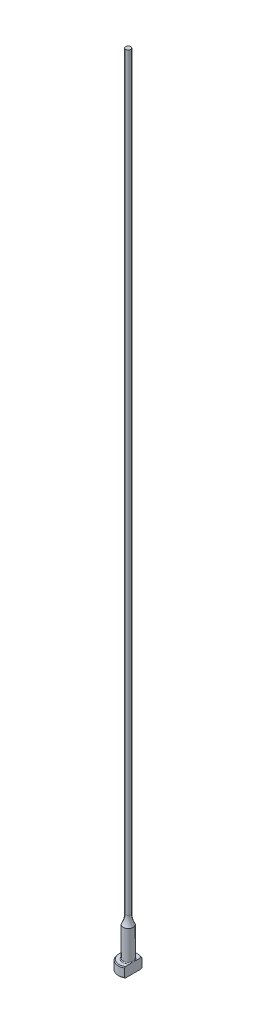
ISO-10303-21;
HEADER;
FILE_DESCRIPTION(('STEP AP214'),'2;1');
FILE_NAME('part.step','',(''),(''),'','','');
FILE_SCHEMA(('AUTOMOTIVE_DESIGN { 1 0 10303 214 1 1 1 1 }'));
ENDSEC;
DATA;
#1=APPLICATION_CONTEXT('core data for automotive mechanical design processes');
#2=APPLICATION_PROTOCOL_DEFINITION('international standard','automotive_design',2000,#1);
#3=PRODUCT_CONTEXT('',#1,'mechanical');
#4=PRODUCT('Part','Part','',(#3));
#5=PRODUCT_RELATED_PRODUCT_CATEGORY('part','',(#4));
#6=PRODUCT_DEFINITION_FORMATION('','',#4);
#7=PRODUCT_DEFINITION_CONTEXT('part definition',#1,'design');
#8=PRODUCT_DEFINITION('design','',#6,#7);
#9=PRODUCT_DEFINITION_SHAPE('','',#8);
#10=(LENGTH_UNIT() NAMED_UNIT(*) SI_UNIT(.MILLI.,.METRE.));
#11=(NAMED_UNIT(*) PLANE_ANGLE_UNIT() SI_UNIT($,.RADIAN.));
#12=(NAMED_UNIT(*) SI_UNIT($,.STERADIAN.) SOLID_ANGLE_UNIT());
#13=UNCERTAINTY_MEASURE_WITH_UNIT(LENGTH_MEASURE(1.E-05),#10,'distance_accuracy_value','');
#14=(GEOMETRIC_REPRESENTATION_CONTEXT(3) GLOBAL_UNCERTAINTY_ASSIGNED_CONTEXT((#13)) GLOBAL_UNIT_ASSIGNED_CONTEXT((#10,
#11,#12)) REPRESENTATION_CONTEXT('',''));
#15=CARTESIAN_POINT('',(0.,0.,0.));
#16=DIRECTION('',(0.,0.,1.));
#17=DIRECTION('',(1.,0.,0.));
#18=AXIS2_PLACEMENT_3D('',#15,#16,#17);
#19=CARTESIAN_POINT('',(-3.17499999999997,3.175,0.));
#20=DIRECTION('',(0.,1.,0.));
#21=DIRECTION('',(0.,0.,1.));
#22=AXIS2_PLACEMENT_3D('',#19,#20,#21);
#23=PLANE('',#22);
#24=CARTESIAN_POINT('',(0.,3.175,0.));
#25=DIRECTION('',(0.,1.,0.));
#26=DIRECTION('',(0.,0.,1.));
#27=AXIS2_PLACEMENT_3D('',#24,#25,#26);
#28=CIRCLE('',#27,2.92099999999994);
#29=CARTESIAN_POINT('',(1.58749999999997,3.175,-2.45195529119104));
#30=VERTEX_POINT('',#29);
#31=CARTESIAN_POINT('',(1.58749999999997,3.175,2.45195529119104));
#32=VERTEX_POINT('',#31);
#33=EDGE_CURVE('E105',#30,#32,#28,.T.);
#34=ORIENTED_EDGE('',*,*,#33,.T.);
#35=DIRECTION('',(0.,0.,1.));
#36=VECTOR('',#35,1.);
#37=CARTESIAN_POINT('',(1.58749999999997,3.17499999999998,2.74963065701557));
#38=LINE('',#37,#36);
#39=CARTESIAN_POINT('',(1.58749999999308,3.175,0.933255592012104));
#40=VERTEX_POINT('',#39);
#41=EDGE_CURVE('E126',#40,#32,#38,.T.);
#42=ORIENTED_EDGE('',*,*,#41,.F.);
#43=CARTESIAN_POINT('',(0.,3.175,0.));
#44=DIRECTION('',(0.,1.,0.));
#45=DIRECTION('',(0.,0.,1.));
#46=AXIS2_PLACEMENT_3D('',#43,#44,#45);
#47=CIRCLE('',#46,1.84149999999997);
#48=CARTESIAN_POINT('',(1.58749999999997,3.17500000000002,-0.933255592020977));
#49=VERTEX_POINT('',#48);
#50=EDGE_CURVE('E11',#40,#49,#47,.F.);
#51=ORIENTED_EDGE('',*,*,#50,.T.);
#52=EDGE_CURVE('E52',#30,#49,#38,.T.);
#53=ORIENTED_EDGE('',*,*,#52,.F.);
#54=EDGE_LOOP('',(#34,#42,#51,#53));
#55=FACE_BOUND('',#54,.T.);
#56=ADVANCED_FACE('F32',(#55),#23,.T.);
#57=CARTESIAN_POINT('',(0.,259.958771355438,0.));
#58=DIRECTION('',(0.,1.,0.));
#59=DIRECTION('',(0.,0.,1.));
#60=AXIS2_PLACEMENT_3D('',#57,#58,#59);
#61=CYLINDRICAL_SURFACE('',#60,3.17499999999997);
#62=CARTESIAN_POINT('',(0.,2.92100000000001,0.));
#63=DIRECTION('',(0.,1.,0.));
#64=DIRECTION('',(0.,0.,1.));
#65=AXIS2_PLACEMENT_3D('',#62,#63,#64);
#66=CIRCLE('',#65,3.17499999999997);
#67=CARTESIAN_POINT('',(1.58749999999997,2.92100000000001,2.74963065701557));
#68=VERTEX_POINT('',#67);
#69=CARTESIAN_POINT('',(1.58749999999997,2.92100000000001,-2.74963065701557));
#70=VERTEX_POINT('',#69);
#71=EDGE_CURVE('E98',#68,#70,#66,.F.);
#72=ORIENTED_EDGE('',*,*,#71,.T.);
#73=DIRECTION('',(0.,-1.,0.));
#74=VECTOR('',#73,1.);
#75=CARTESIAN_POINT('',(1.58749999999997,254.001,-2.74963065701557));
#76=LINE('',#75,#74);
#77=CARTESIAN_POINT('',(1.58749999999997,0.253999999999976,-2.74963065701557));
#78=VERTEX_POINT('',#77);
#79=EDGE_CURVE('E141',#70,#78,#76,.T.);
#80=ORIENTED_EDGE('',*,*,#79,.T.);
#81=CARTESIAN_POINT('',(0.,0.253999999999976,0.));
#82=DIRECTION('',(0.,-1.,0.));
#83=DIRECTION('',(0.,0.,-1.));
#84=AXIS2_PLACEMENT_3D('',#81,#82,#83);
#85=CIRCLE('',#84,3.17499999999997);
#86=CARTESIAN_POINT('',(1.58749999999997,0.253999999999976,2.74963065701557));
#87=VERTEX_POINT('',#86);
#88=EDGE_CURVE('E95',#78,#87,#85,.F.);
#89=ORIENTED_EDGE('',*,*,#88,.T.);
#90=DIRECTION('',(0.,-1.,0.));
#91=VECTOR('',#90,1.);
#92=CARTESIAN_POINT('',(1.58749999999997,254.001,2.74963065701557));
#93=LINE('',#92,#91);
#94=EDGE_CURVE('E88',#68,#87,#93,.T.);
#95=ORIENTED_EDGE('',*,*,#94,.F.);
#96=EDGE_LOOP('',(#72,#80,#89,#95));
#97=FACE_BOUND('',#96,.T.);
#98=ADVANCED_FACE('F191',(#97),#61,.T.);
#99=CARTESIAN_POINT('',(0.,0.,0.));
#100=DIRECTION('',(0.,-1.,0.));
#101=DIRECTION('',(0.,0.,-1.));
#102=AXIS2_PLACEMENT_3D('',#99,#100,#101);
#103=PLANE('',#102);
#104=CARTESIAN_POINT('',(0.,0.,0.));
#105=DIRECTION('',(0.,-1.,0.));
#106=DIRECTION('',(0.,0.,-1.));
#107=AXIS2_PLACEMENT_3D('',#104,#105,#106);
#108=CIRCLE('',#107,2.92100000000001);
#109=CARTESIAN_POINT('',(1.58749999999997,0.,2.45195529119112));
#110=VERTEX_POINT('',#109);
#111=CARTESIAN_POINT('',(1.58749999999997,0.,-2.45195529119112));
#112=VERTEX_POINT('',#111);
#113=EDGE_CURVE('E93',#110,#112,#108,.T.);
#114=ORIENTED_EDGE('',*,*,#113,.T.);
#115=DIRECTION('',(0.,0.,1.));
#116=VECTOR('',#115,1.);
#117=CARTESIAN_POINT('',(1.58749999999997,0.,2.74963065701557));
#118=LINE('',#117,#116);
#119=EDGE_CURVE('E78',#112,#110,#118,.T.);
#120=ORIENTED_EDGE('',*,*,#119,.T.);
#121=EDGE_LOOP('',(#114,#120));
#122=FACE_BOUND('',#121,.T.);
#123=ADVANCED_FACE('F97',(#122),#103,.T.);
#124=CARTESIAN_POINT('',(0.,3.17499999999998,0.));
#125=DIRECTION('',(0.,-1.,0.));
#126=DIRECTION('',(0.,0.,-1.));
#127=AXIS2_PLACEMENT_3D('',#124,#125,#126);
#128=CONICAL_SURFACE('',#127,2.92099999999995,0.785398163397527);
#129=ORIENTED_EDGE('',*,*,#71,.F.);
#130=CARTESIAN_POINT('',(1.58749999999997,-0.16162066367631,-6.0529050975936));
#131=CARTESIAN_POINT('',(1.58749999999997,-0.0288893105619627,-5.91567682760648));
#132=CARTESIAN_POINT('',(1.58749999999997,0.103699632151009,-5.7783103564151));
#133=CARTESIAN_POINT('',(1.58749999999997,0.368508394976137,-5.50321874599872));
#134=CARTESIAN_POINT('',(1.58749999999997,0.500728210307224,-5.36549360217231));
#135=CARTESIAN_POINT('',(1.58749999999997,0.764778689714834,-5.08953516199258));
#136=CARTESIAN_POINT('',(1.58749999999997,0.896609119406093,-4.9513016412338));
#137=CARTESIAN_POINT('',(1.58749999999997,1.15968706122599,-4.67428233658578));
#138=CARTESIAN_POINT('',(1.58749999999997,1.29093457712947,-4.53549655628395));
#139=CARTESIAN_POINT('',(1.58749999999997,1.55007705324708,-4.25997724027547));
#140=CARTESIAN_POINT('',(1.58749999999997,1.67798684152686,-4.12325766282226));
#141=CARTESIAN_POINT('',(1.58749999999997,1.9328486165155,-3.84892898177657));
#142=CARTESIAN_POINT('',(1.58749999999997,2.05980060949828,-3.71131988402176));
#143=CARTESIAN_POINT('',(1.58749999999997,2.31237508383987,-3.43493978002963));
#144=CARTESIAN_POINT('',(1.58749999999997,2.43799784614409,-3.29616903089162));
#145=CARTESIAN_POINT('',(1.58749999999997,2.68741369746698,-3.01699558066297));
#146=CARTESIAN_POINT('',(1.58749999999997,2.81120686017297,-2.8765929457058));
#147=CARTESIAN_POINT('',(1.58749999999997,3.00875865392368,-2.64816703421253));
#148=CARTESIAN_POINT('',(1.58749999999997,3.08336151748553,-2.56087478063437));
#149=CARTESIAN_POINT('',(1.58749999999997,3.2312387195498,-2.38515423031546));
#150=CARTESIAN_POINT('',(1.58749999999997,3.30451292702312,-2.29672582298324));
#151=CARTESIAN_POINT('',(1.58749999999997,3.45004422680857,-2.1174740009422));
#152=CARTESIAN_POINT('',(1.58749999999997,3.5222823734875,-2.02663514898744));
#153=CARTESIAN_POINT('',(1.58749999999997,3.66423097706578,-1.8430252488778));
#154=CARTESIAN_POINT('',(1.58749999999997,3.73394203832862,-1.75025467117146));
#155=CARTESIAN_POINT('',(1.58749999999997,3.87080633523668,-1.5606747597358));
#156=CARTESIAN_POINT('',(1.58749999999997,3.93790459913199,-1.46382547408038));
#157=CARTESIAN_POINT('',(1.58749999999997,4.06669147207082,-1.26632594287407));
#158=CARTESIAN_POINT('',(1.58749999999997,4.1283726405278,-1.16567073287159));
#159=CARTESIAN_POINT('',(1.58749999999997,4.21402252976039,-1.01165766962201));
#160=CARTESIAN_POINT('',(1.58749999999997,4.24127929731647,-0.960142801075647));
#161=CARTESIAN_POINT('',(1.58749999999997,4.2930979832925,-0.855780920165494));
#162=CARTESIAN_POINT('',(1.58749999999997,4.31765941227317,-0.802933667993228));
#163=CARTESIAN_POINT('',(1.58749999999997,4.38614656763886,-0.642461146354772));
#164=CARTESIAN_POINT('',(1.58749999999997,4.42510149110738,-0.532518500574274));
#165=CARTESIAN_POINT('',(1.58749999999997,4.46726244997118,-0.367680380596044));
#166=CARTESIAN_POINT('',(1.58749999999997,4.47844427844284,-0.314802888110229));
#167=CARTESIAN_POINT('',(1.58749999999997,4.49576654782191,-0.208209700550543));
#168=CARTESIAN_POINT('',(1.58749999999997,4.50190743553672,-0.154494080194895));
#169=CARTESIAN_POINT('',(1.58749999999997,4.50871296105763,-0.0468792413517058));
#170=CARTESIAN_POINT('',(1.58749999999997,4.5093945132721,0.00701889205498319));
#171=CARTESIAN_POINT('',(1.58749999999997,4.50527679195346,0.114606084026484));
#172=CARTESIAN_POINT('',(1.58749999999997,4.50047706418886,0.168295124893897));
#173=CARTESIAN_POINT('',(1.58749999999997,4.48579689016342,0.27448544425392));
#174=CARTESIAN_POINT('',(1.58749999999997,4.47596081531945,0.32699298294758));
#175=CARTESIAN_POINT('',(1.58749999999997,4.45181809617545,0.430974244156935));
#176=CARTESIAN_POINT('',(1.58749999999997,4.4375096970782,0.482447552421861));
#177=CARTESIAN_POINT('',(1.58749999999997,4.40502489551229,0.584460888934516));
#178=CARTESIAN_POINT('',(1.58749999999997,4.386827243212,0.634994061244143));
#179=CARTESIAN_POINT('',(1.58749999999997,4.34729308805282,0.734789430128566));
#180=CARTESIAN_POINT('',(1.58749999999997,4.3259572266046,0.784051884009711));
#181=CARTESIAN_POINT('',(1.58749999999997,4.25791922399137,0.930549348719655));
#182=CARTESIAN_POINT('',(1.58749999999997,4.20736047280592,1.0259880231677));
#183=CARTESIAN_POINT('',(1.58749999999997,4.0995545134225,1.21304313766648));
#184=CARTESIAN_POINT('',(1.58749999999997,4.04229912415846,1.30465471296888));
#185=CARTESIAN_POINT('',(1.58749999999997,3.92308746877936,1.48526211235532));
#186=CARTESIAN_POINT('',(1.58749999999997,3.86111349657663,1.57424615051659));
#187=CARTESIAN_POINT('',(1.58749999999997,3.73408621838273,1.74990003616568));
#188=CARTESIAN_POINT('',(1.58749999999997,3.66903444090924,1.83657099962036));
#189=CARTESIAN_POINT('',(1.58749999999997,3.53583371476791,2.00931764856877));
#190=CARTESIAN_POINT('',(1.58749999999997,3.46765527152,2.09537048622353));
#191=CARTESIAN_POINT('',(1.58749999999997,3.32960643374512,2.26611736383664));
#192=CARTESIAN_POINT('',(1.58749999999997,3.25973586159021,2.35081125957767));
#193=CARTESIAN_POINT('',(1.58749999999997,3.04858139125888,2.60290121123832));
#194=CARTESIAN_POINT('',(1.58749999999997,2.90542388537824,2.76872537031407));
#195=CARTESIAN_POINT('',(1.58749999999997,2.64069522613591,3.06970913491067));
#196=CARTESIAN_POINT('',(1.58749999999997,2.51959458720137,3.20528660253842));
#197=CARTESIAN_POINT('',(1.58749999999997,2.27590400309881,3.47510321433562));
#198=CARTESIAN_POINT('',(1.58749999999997,2.15331401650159,3.60934232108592));
#199=CARTESIAN_POINT('',(1.58749999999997,1.90694239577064,3.87695374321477));
#200=CARTESIAN_POINT('',(1.58749999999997,1.78315974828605,4.0103251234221));
#201=CARTESIAN_POINT('',(1.58749999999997,1.53478104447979,4.27630880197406));
#202=CARTESIAN_POINT('',(1.58749999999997,1.41018498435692,4.40892109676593));
#203=CARTESIAN_POINT('',(1.58749999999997,1.0457468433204,4.79499418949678));
#204=CARTESIAN_POINT('',(1.58749999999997,0.80507680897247,5.04767313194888));
#205=CARTESIAN_POINT('',(1.58749999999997,0.443121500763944,5.42550911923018));
#206=CARTESIAN_POINT('',(1.58749999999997,0.322378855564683,5.55118772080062));
#207=CARTESIAN_POINT('',(1.58749999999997,0.0805914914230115,5.80225207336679));
#208=CARTESIAN_POINT('',(1.58749999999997,-0.040453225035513,5.92763782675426));
#209=CARTESIAN_POINT('',(1.58749999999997,-0.161620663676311,6.0529050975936));
#210=B_SPLINE_CURVE_WITH_KNOTS('',3,(#130,#131,#132,#133,#134,#135,#136,#137,#138,#139,#140,
#141,#142,#143,#144,#145,#146,#147,#148,#149,#150,#151,#152,#153,#154,#155,#156,#157,#158,#159,
#160,#161,#162,#163,#164,#165,#166,#167,#168,#169,#170,#171,#172,#173,#174,#175,#176,#177,#178,
#179,#180,#181,#182,#183,#184,#185,#186,#187,#188,#189,#190,#191,#192,#193,#194,#195,#196,#197,
#198,#199,#200,#201,#202,#203,#204,#205,#206,#207,#208,#209),.UNSPECIFIED.,.F.,.F.,(4,2,2,2,2,2,
2,2,2,2,2,2,2,2,2,2,2,2,2,2,2,2,2,2,2,2,2,2,2,2,2,2,2,2,2,2,2,2,2,4),(0.,0.572750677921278,
1.14550874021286,1.71856057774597,2.29160869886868,2.85328006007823,3.4149477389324,
3.97649423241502,4.53801804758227,4.88249307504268,5.22700189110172,5.5751532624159,
5.92322081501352,6.27657800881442,6.63041319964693,6.80518126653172,6.9799810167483,
7.3282426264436,7.49018491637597,7.65211285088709,7.81353889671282,7.97497832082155,
8.13501929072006,8.29512313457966,8.45612518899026,8.61709438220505,8.94062993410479,
9.2645649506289,9.58978187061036,9.91483894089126,10.2441741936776,10.5735441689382,
11.2306812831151,11.7760337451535,12.3214014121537,12.8672825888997,13.4131663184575,
14.4600164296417,14.9828595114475,15.5056983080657),.UNSPECIFIED.);
#211=EDGE_CURVE('E118',#32,#68,#210,.T.);
#212=ORIENTED_EDGE('',*,*,#211,.F.);
#213=ORIENTED_EDGE('',*,*,#33,.F.);
#214=EDGE_CURVE('E117',#70,#30,#210,.T.);
#215=ORIENTED_EDGE('',*,*,#214,.F.);
#216=EDGE_LOOP('',(#129,#212,#213,#215));
#217=FACE_BOUND('',#216,.T.);
#218=ADVANCED_FACE('F162',(#217),#128,.T.);
#219=CARTESIAN_POINT('',(0.,0.253999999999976,0.));
#220=DIRECTION('',(0.,1.,0.));
#221=DIRECTION('',(0.,0.,1.));
#222=AXIS2_PLACEMENT_3D('',#219,#220,#221);
#223=CONICAL_SURFACE('',#222,3.17499999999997,0.785398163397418);
#224=ORIENTED_EDGE('',*,*,#88,.F.);
#225=CARTESIAN_POINT('',(1.58749999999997,3.33662066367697,6.0529050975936));
#226=CARTESIAN_POINT('',(1.58749999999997,3.20388931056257,5.91567682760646));
#227=CARTESIAN_POINT('',(1.58749999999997,3.07130036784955,5.77831035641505));
#228=CARTESIAN_POINT('',(1.58749999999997,2.80649160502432,5.50321874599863));
#229=CARTESIAN_POINT('',(1.58749999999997,2.67427178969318,5.3654936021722));
#230=CARTESIAN_POINT('',(1.58749999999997,2.41022131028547,5.08953516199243));
#231=CARTESIAN_POINT('',(1.58749999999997,2.27839088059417,4.95130164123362));
#232=CARTESIAN_POINT('',(1.58749999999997,2.01531293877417,4.67428233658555));
#233=CARTESIAN_POINT('',(1.58749999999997,1.88406542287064,4.5354965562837));
#234=CARTESIAN_POINT('',(1.58749999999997,1.62492294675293,4.25997724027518));
#235=CARTESIAN_POINT('',(1.58749999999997,1.49701315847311,4.12325766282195));
#236=CARTESIAN_POINT('',(1.58749999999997,1.24215138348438,3.84892898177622));
#237=CARTESIAN_POINT('',(1.58749999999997,1.11519939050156,3.71131988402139));
#238=CARTESIAN_POINT('',(1.58749999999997,0.862624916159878,3.43493978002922));
#239=CARTESIAN_POINT('',(1.58749999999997,0.737002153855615,3.29616903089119));
#240=CARTESIAN_POINT('',(1.58749999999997,0.487586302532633,3.01699558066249));
#241=CARTESIAN_POINT('',(1.58749999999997,0.363793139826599,2.8765929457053));
#242=CARTESIAN_POINT('',(1.58749999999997,0.166241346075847,2.64816703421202));
#243=CARTESIAN_POINT('',(1.58749999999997,0.0916384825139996,2.56087478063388));
#244=CARTESIAN_POINT('',(1.58749999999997,-0.0562387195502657,2.385154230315));
#245=CARTESIAN_POINT('',(1.58749999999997,-0.129512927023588,2.29672582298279));
#246=CARTESIAN_POINT('',(1.58749999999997,-0.27504422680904,2.11747400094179));
#247=CARTESIAN_POINT('',(1.58749999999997,-0.347282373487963,2.02663514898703));
#248=CARTESIAN_POINT('',(1.58749999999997,-0.489230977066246,1.84302524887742));
#249=CARTESIAN_POINT('',(1.58749999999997,-0.558942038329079,1.7502546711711));
#250=CARTESIAN_POINT('',(1.58749999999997,-0.695806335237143,1.56067475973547));
#251=CARTESIAN_POINT('',(1.58749999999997,-0.762904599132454,1.46382547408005));
#252=CARTESIAN_POINT('',(1.58749999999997,-0.891691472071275,1.26632594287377));
#253=CARTESIAN_POINT('',(1.58749999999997,-0.953372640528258,1.16567073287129));
#254=CARTESIAN_POINT('',(1.58749999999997,-1.03902252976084,1.01165766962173));
#255=CARTESIAN_POINT('',(1.58749999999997,-1.06627929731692,0.960142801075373));
#256=CARTESIAN_POINT('',(1.58749999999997,-1.11809798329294,0.85578092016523));
#257=CARTESIAN_POINT('',(1.58749999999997,-1.14265941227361,0.802933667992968));
#258=CARTESIAN_POINT('',(1.58749999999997,-1.21114656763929,0.642461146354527));
#259=CARTESIAN_POINT('',(1.58749999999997,-1.2501014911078,0.532518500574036));
#260=CARTESIAN_POINT('',(1.58749999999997,-1.29226244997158,0.367680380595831));
#261=CARTESIAN_POINT('',(1.58749999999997,-1.30344427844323,0.314802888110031));
#262=CARTESIAN_POINT('',(1.58749999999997,-1.32076654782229,0.208209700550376));
#263=CARTESIAN_POINT('',(1.58749999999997,-1.3269074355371,0.154494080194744));
#264=CARTESIAN_POINT('',(1.58749999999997,-1.333712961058,0.0468792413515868));
#265=CARTESIAN_POINT('',(1.58749999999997,-1.33439451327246,-0.00701889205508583));
#266=CARTESIAN_POINT('',(1.58749999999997,-1.33027679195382,-0.114606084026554));
#267=CARTESIAN_POINT('',(1.58749999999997,-1.32547706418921,-0.168295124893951));
#268=CARTESIAN_POINT('',(1.58749999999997,-1.31079689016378,-0.274485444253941));
#269=CARTESIAN_POINT('',(1.58749999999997,-1.3009608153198,-0.326992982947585));
#270=CARTESIAN_POINT('',(1.58749999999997,-1.27681809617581,-0.430974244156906));
#271=CARTESIAN_POINT('',(1.58749999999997,-1.26250969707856,-0.482447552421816));
#272=CARTESIAN_POINT('',(1.58749999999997,-1.23002489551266,-0.584460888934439));
#273=CARTESIAN_POINT('',(1.58749999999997,-1.21182724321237,-0.634994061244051));
#274=CARTESIAN_POINT('',(1.58749999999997,-1.1722930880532,-0.734789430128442));
#275=CARTESIAN_POINT('',(1.58749999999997,-1.15095722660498,-0.784051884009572));
#276=CARTESIAN_POINT('',(1.58749999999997,-1.08291922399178,-0.93054934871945));
#277=CARTESIAN_POINT('',(1.58749999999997,-1.03236047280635,-1.02598802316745));
#278=CARTESIAN_POINT('',(1.58749999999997,-0.924554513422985,-1.21304313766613));
#279=CARTESIAN_POINT('',(1.58749999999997,-0.86729912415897,-1.30465471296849));
#280=CARTESIAN_POINT('',(1.58749999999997,-0.748087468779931,-1.48526211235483));
#281=CARTESIAN_POINT('',(1.58749999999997,-0.686113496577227,-1.57424615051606));
#282=CARTESIAN_POINT('',(1.58749999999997,-0.55908621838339,-1.74990003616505));
#283=CARTESIAN_POINT('',(1.58749999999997,-0.494034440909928,-1.83657099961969));
#284=CARTESIAN_POINT('',(1.58749999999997,-0.360833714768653,-2.00931764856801));
#285=CARTESIAN_POINT('',(1.58749999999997,-0.292655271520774,-2.09537048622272));
#286=CARTESIAN_POINT('',(1.58749999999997,-0.154606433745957,-2.26611736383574));
#287=CARTESIAN_POINT('',(1.58749999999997,-0.0847358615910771,-2.35081125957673));
#288=CARTESIAN_POINT('',(1.58749999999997,0.126418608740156,-2.60290121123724));
#289=CARTESIAN_POINT('',(1.58749999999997,0.269576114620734,-2.76872537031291));
#290=CARTESIAN_POINT('',(1.58749999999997,0.534304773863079,-3.06970913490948));
#291=CARTESIAN_POINT('',(1.58749999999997,0.655405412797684,-3.20528660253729));
#292=CARTESIAN_POINT('',(1.58749999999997,0.899095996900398,-3.47510321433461));
#293=CARTESIAN_POINT('',(1.58749999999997,1.02168598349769,-3.60934232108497));
#294=CARTESIAN_POINT('',(1.58749999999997,1.26805760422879,-3.87695374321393));
#295=CARTESIAN_POINT('',(1.58749999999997,1.39184025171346,-4.01032512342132));
#296=CARTESIAN_POINT('',(1.58749999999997,1.64021895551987,-4.2763088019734));
#297=CARTESIAN_POINT('',(1.58749999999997,1.76481501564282,-4.40892109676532));
#298=CARTESIAN_POINT('',(1.58749999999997,2.12925315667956,-4.79499418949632));
#299=CARTESIAN_POINT('',(1.58749999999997,2.36992319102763,-5.04767313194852));
#300=CARTESIAN_POINT('',(1.58749999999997,2.73187849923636,-5.42550911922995));
#301=CARTESIAN_POINT('',(1.58749999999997,2.85262114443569,-5.55118772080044));
#302=CARTESIAN_POINT('',(1.58749999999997,3.09440850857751,-5.8022520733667));
#303=CARTESIAN_POINT('',(1.58749999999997,3.2154532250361,-5.92763782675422));
#304=CARTESIAN_POINT('',(1.58749999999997,3.33662066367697,-6.0529050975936));
#305=B_SPLINE_CURVE_WITH_KNOTS('',3,(#225,#226,#227,#228,#229,#230,#231,#232,#233,#234,#235,
#236,#237,#238,#239,#240,#241,#242,#243,#244,#245,#246,#247,#248,#249,#250,#251,#252,#253,#254,
#255,#256,#257,#258,#259,#260,#261,#262,#263,#264,#265,#266,#267,#268,#269,#270,#271,#272,#273,
#274,#275,#276,#277,#278,#279,#280,#281,#282,#283,#284,#285,#286,#287,#288,#289,#290,#291,#292,
#293,#294,#295,#296,#297,#298,#299,#300,#301,#302,#303,#304),.UNSPECIFIED.,.F.,.F.,(4,2,2,2,2,2,
2,2,2,2,2,2,2,2,2,2,2,2,2,2,2,2,2,2,2,2,2,2,2,2,2,2,2,2,2,2,2,2,2,4),(0.,0.57275067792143,
1.14550874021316,1.71856057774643,2.29160869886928,2.85328006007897,3.41494773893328,
3.97649423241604,4.53801804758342,4.88249307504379,5.2270018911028,5.57515326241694,
5.92322081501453,6.27657800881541,6.63041319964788,6.80518126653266,6.97998101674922,
7.32824262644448,7.49018491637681,7.65211285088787,7.81353889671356,7.97497832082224,
8.1350192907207,8.29512313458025,8.45612518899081,8.61709438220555,8.94062993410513,
9.26456495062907,9.58978187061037,9.91483894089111,10.2441741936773,10.5735441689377,
11.2306812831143,11.776033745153,12.3214014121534,12.8672825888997,13.4131663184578,
14.4600164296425,14.9828595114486,15.505698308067),.UNSPECIFIED.);
#306=EDGE_CURVE('E81',#112,#78,#305,.T.);
#307=ORIENTED_EDGE('',*,*,#306,.F.);
#308=ORIENTED_EDGE('',*,*,#113,.F.);
#309=EDGE_CURVE('E84',#87,#110,#305,.T.);
#310=ORIENTED_EDGE('',*,*,#309,.F.);
#311=EDGE_LOOP('',(#224,#307,#308,#310));
#312=FACE_BOUND('',#311,.T.);
#313=ADVANCED_FACE('F92',(#312),#223,.T.);
#314=CARTESIAN_POINT('',(0.,3.42900000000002,0.));
#315=DIRECTION('',(0.,1.,0.));
#316=DIRECTION('',(0.,0.,1.));
#317=AXIS2_PLACEMENT_3D('',#314,#315,#316);
#318=TOROIDAL_SURFACE('',#317,1.84149999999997,0.254);
#319=CARTESIAN_POINT('',(1.58749999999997,3.42900000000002,0.));
#320=CARTESIAN_POINT('',(1.58749999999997,3.42899942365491,-1.9220514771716E-10));
#321=CARTESIAN_POINT('',(1.58749999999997,3.42899884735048,-1.2261161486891E-07));
#322=CARTESIAN_POINT('',(1.58749999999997,3.42899773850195,-5.09676365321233E-07));
#323=CARTESIAN_POINT('',(1.58749999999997,3.42899720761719,-7.78176328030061E-07));
#324=CARTESIAN_POINT('',(1.58749999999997,3.42899614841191,-1.42307272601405E-06));
#325=CARTESIAN_POINT('',(1.58749999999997,3.42899562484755,-1.80713867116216E-06));
#326=CARTESIAN_POINT('',(1.58749999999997,3.42899463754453,-2.63494846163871E-06));
#327=CARTESIAN_POINT('',(1.58749999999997,3.42899417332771,-3.07814756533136E-06));
#328=CARTESIAN_POINT('',(1.58749999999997,3.42899261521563,-4.66897357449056E-06));
#329=CARTESIAN_POINT('',(1.58749999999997,3.42899159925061,-5.89404908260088E-06));
#330=CARTESIAN_POINT('',(1.58749999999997,3.42898979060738,-8.42427511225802E-06));
#331=CARTESIAN_POINT('',(1.58749999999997,3.42898899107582,-9.7248057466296E-06));
#332=CARTESIAN_POINT('',(1.58749999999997,3.42898598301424,-1.48060601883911E-05));
#333=CARTESIAN_POINT('',(1.58749999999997,3.42898393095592,-1.86838281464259E-05));
#334=CARTESIAN_POINT('',(1.58749999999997,3.42898057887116,-2.63261117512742E-05));
#335=CARTESIAN_POINT('',(1.58749999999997,3.42897922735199,-3.00687417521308E-05));
#336=CARTESIAN_POINT('',(1.58749999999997,3.42897347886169,-4.60276298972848E-05));
#337=CARTESIAN_POINT('',(1.58749999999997,3.42896911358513,-5.8247019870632E-05));
#338=CARTESIAN_POINT('',(1.58749999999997,3.42896211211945,-8.11070097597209E-05));
#339=CARTESIAN_POINT('',(1.58749999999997,3.42895931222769,-9.16953114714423E-05));
#340=CARTESIAN_POINT('',(1.58749999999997,3.42893712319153,-0.000168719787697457));
#341=CARTESIAN_POINT('',(1.58749999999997,3.42890881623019,-0.000232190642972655));
#342=CARTESIAN_POINT('',(1.58749999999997,3.42880276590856,-0.000479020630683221));
#343=CARTESIAN_POINT('',(1.58749999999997,3.42873165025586,-0.00066443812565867));
#344=CARTESIAN_POINT('',(1.58749999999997,3.42845137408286,-0.0013844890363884));
#345=CARTESIAN_POINT('',(1.58749999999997,3.42823526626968,-0.00191701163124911));
#346=CARTESIAN_POINT('',(1.58749999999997,3.42735449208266,-0.00409774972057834));
#347=CARTESIAN_POINT('',(1.58749999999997,3.42669768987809,-0.00574830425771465));
#348=CARTESIAN_POINT('',(1.58749999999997,3.4174405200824,-0.0289985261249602));
#349=CARTESIAN_POINT('',(1.58749999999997,3.40878325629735,-0.0505816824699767));
#350=CARTESIAN_POINT('',(1.58749999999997,3.39189297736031,-0.0929947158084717));
#351=CARTESIAN_POINT('',(1.58749999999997,3.38365605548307,-0.11382315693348));
#352=CARTESIAN_POINT('',(1.58749999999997,3.36635393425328,-0.157956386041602));
#353=CARTESIAN_POINT('',(1.58749999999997,3.35730391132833,-0.181267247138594));
#354=CARTESIAN_POINT('',(1.58749999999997,3.33936775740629,-0.228222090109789));
#355=CARTESIAN_POINT('',(1.58749999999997,3.33048420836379,-0.25186705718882));
#356=CARTESIAN_POINT('',(1.58749999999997,3.30894496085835,-0.310512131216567));
#357=CARTESIAN_POINT('',(1.58749999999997,3.29649449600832,-0.345588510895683));
#358=CARTESIAN_POINT('',(1.58749999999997,3.27296975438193,-0.415278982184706));
#359=CARTESIAN_POINT('',(1.58749999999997,3.26186987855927,-0.449884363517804));
#360=CARTESIAN_POINT('',(1.58749999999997,3.2395832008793,-0.524471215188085));
#361=CARTESIAN_POINT('',(1.58749999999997,3.22860862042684,-0.564517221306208));
#362=CARTESIAN_POINT('',(1.58749999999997,3.20902534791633,-0.645529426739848));
#363=CARTESIAN_POINT('',(1.58749999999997,3.20043582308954,-0.686500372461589));
#364=CARTESIAN_POINT('',(1.58749999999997,3.18611712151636,-0.771546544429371));
#365=CARTESIAN_POINT('',(1.58749999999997,3.18059550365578,-0.815658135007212));
#366=CARTESIAN_POINT('',(1.58749999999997,3.17455396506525,-0.904117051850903));
#367=CARTESIAN_POINT('',(1.58749999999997,3.17401361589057,-0.948462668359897));
#368=CARTESIAN_POINT('',(1.58749999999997,3.17898948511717,-1.02531896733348));
#369=CARTESIAN_POINT('',(1.58749999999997,3.1829739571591,-1.05792141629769));
#370=CARTESIAN_POINT('',(1.58749999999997,3.19569167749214,-1.12184393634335));
#371=CARTESIAN_POINT('',(1.58749999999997,3.20436049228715,-1.1531753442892));
#372=CARTESIAN_POINT('',(1.58749999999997,3.22236152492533,-1.19946468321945));
#373=CARTESIAN_POINT('',(1.58749999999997,3.2295150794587,-1.21526783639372));
#374=CARTESIAN_POINT('',(1.58749999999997,3.24587062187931,-1.24583726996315));
#375=CARTESIAN_POINT('',(1.58749999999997,3.25507530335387,-1.26060215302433));
#376=CARTESIAN_POINT('',(1.58749999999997,3.27378481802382,-1.28575815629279));
#377=CARTESIAN_POINT('',(1.58749999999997,3.28289001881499,-1.29644383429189));
#378=CARTESIAN_POINT('',(1.58749999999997,3.30268460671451,-1.31623154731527));
#379=CARTESIAN_POINT('',(1.58749999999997,3.31337067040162,-1.32533681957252));
#380=CARTESIAN_POINT('',(1.58749999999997,3.33349977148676,-1.33941140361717));
#381=CARTESIAN_POINT('',(1.58749999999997,3.34261446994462,-1.34484814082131));
#382=CARTESIAN_POINT('',(1.58749999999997,3.36161455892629,-1.35416329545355));
#383=CARTESIAN_POINT('',(1.58749999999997,3.37149946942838,-1.35804267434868));
#384=CARTESIAN_POINT('',(1.58749999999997,3.39188678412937,-1.36398436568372));
#385=CARTESIAN_POINT('',(1.58749999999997,3.40239309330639,-1.36603350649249));
#386=CARTESIAN_POINT('',(1.58749999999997,3.42360372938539,-1.3680840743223));
#387=CARTESIAN_POINT('',(1.58749999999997,3.43430795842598,-1.36808648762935));
#388=CARTESIAN_POINT('',(1.58749999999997,3.45433283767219,-1.36616208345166));
#389=CARTESIAN_POINT('',(1.58749999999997,3.46367506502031,-1.36444960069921));
#390=CARTESIAN_POINT('',(1.58749999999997,3.48195519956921,-1.35953338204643));
#391=CARTESIAN_POINT('',(1.58749999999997,3.49089304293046,-1.3563294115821));
#392=CARTESIAN_POINT('',(1.58749999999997,3.50850302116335,-1.34848006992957));
#393=CARTESIAN_POINT('',(1.58749999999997,3.5171531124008,-1.34378578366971));
#394=CARTESIAN_POINT('',(1.58749999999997,3.53371257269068,-1.33324445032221));
#395=CARTESIAN_POINT('',(1.58749999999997,3.54162163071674,-1.32739692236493));
#396=CARTESIAN_POINT('',(1.58749999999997,3.56107121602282,-1.31107304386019));
#397=CARTESIAN_POINT('',(1.58749999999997,3.57202221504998,-1.29989286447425));
#398=CARTESIAN_POINT('',(1.58749999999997,3.59202509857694,-1.27593566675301));
#399=CARTESIAN_POINT('',(1.58749999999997,3.60107086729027,-1.26315370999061));
#400=CARTESIAN_POINT('',(1.58749999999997,3.62186023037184,-1.22930733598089));
#401=CARTESIAN_POINT('',(1.58749999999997,3.63240584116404,-1.20751096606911));
#402=CARTESIAN_POINT('',(1.58749999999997,3.65004643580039,-1.16266144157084));
#403=CARTESIAN_POINT('',(1.58749999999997,3.65714435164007,-1.13960937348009));
#404=CARTESIAN_POINT('',(1.58749999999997,3.67265428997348,-1.07603916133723));
#405=CARTESIAN_POINT('',(1.58749999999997,3.67834921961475,-1.03486686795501));
#406=CARTESIAN_POINT('',(1.58749999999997,3.68382880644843,-0.951558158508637));
#407=CARTESIAN_POINT('',(1.58749999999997,3.68350976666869,-0.909417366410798));
#408=CARTESIAN_POINT('',(1.58749999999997,3.67745397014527,-0.811383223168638));
#409=CARTESIAN_POINT('',(1.58749999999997,3.66993873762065,-0.755610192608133));
#410=CARTESIAN_POINT('',(1.58749999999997,3.64933373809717,-0.644937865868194));
#411=CARTESIAN_POINT('',(1.58749999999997,3.63621897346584,-0.59004364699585));
#412=CARTESIAN_POINT('',(1.58749999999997,3.60740922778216,-0.485757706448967));
#413=CARTESIAN_POINT('',(1.58749999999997,3.59201096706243,-0.436281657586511));
#414=CARTESIAN_POINT('',(1.58749999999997,3.55922497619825,-0.338551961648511));
#415=CARTESIAN_POINT('',(1.58749999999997,3.5418584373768,-0.290291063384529));
#416=CARTESIAN_POINT('',(1.58749999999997,3.51760237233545,-0.225557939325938));
#417=CARTESIAN_POINT('',(1.58749999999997,3.51126413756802,-0.208874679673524));
#418=CARTESIAN_POINT('',(1.58749999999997,3.49830042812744,-0.17512392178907));
#419=CARTESIAN_POINT('',(1.58749999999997,3.49167176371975,-0.158057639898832));
#420=CARTESIAN_POINT('',(1.58749999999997,3.47585523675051,-0.117638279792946));
#421=CARTESIAN_POINT('',(1.58749999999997,3.46662970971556,-0.0943002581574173));
#422=CARTESIAN_POINT('',(1.58749999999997,3.44889695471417,-0.0497824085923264));
#423=CARTESIAN_POINT('',(1.58749999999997,3.44040039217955,-0.028598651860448));
#424=CARTESIAN_POINT('',(1.58749999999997,3.43130364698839,-0.00575168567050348));
#425=CARTESIAN_POINT('',(1.58749999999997,3.43064818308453,-0.00410451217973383));
#426=CARTESIAN_POINT('',(1.58749999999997,3.42976776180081,-0.00192459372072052));
#427=CARTESIAN_POINT('',(1.58749999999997,3.42955062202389,-0.00138952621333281));
#428=CARTESIAN_POINT('',(1.58749999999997,3.42926908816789,-0.000666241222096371));
#429=CARTESIAN_POINT('',(1.58749999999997,3.42919771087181,-0.000480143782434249));
#430=CARTESIAN_POINT('',(1.58749999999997,3.42909131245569,-0.000232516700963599));
#431=CARTESIAN_POINT('',(1.58749999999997,3.42906294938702,-0.000168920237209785));
#432=CARTESIAN_POINT('',(1.58749999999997,3.42904072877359,-9.17527162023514E-05));
#433=CARTESIAN_POINT('',(1.58749999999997,3.42903792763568,-8.11550293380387E-05));
#434=CARTESIAN_POINT('',(1.58749999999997,3.42903091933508,-5.82743948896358E-05));
#435=CARTESIAN_POINT('',(1.58749999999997,3.42902654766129,-4.60440001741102E-05));
#436=CARTESIAN_POINT('',(1.58749999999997,3.42902079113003,-3.00727682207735E-05));
#437=CARTESIAN_POINT('',(1.58749999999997,3.42901943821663,-2.63286807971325E-05));
#438=CARTESIAN_POINT('',(1.58749999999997,3.42901608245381,-1.86836529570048E-05));
#439=CARTESIAN_POINT('',(1.58749999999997,3.4290140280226,-1.48046517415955E-05));
#440=CARTESIAN_POINT('',(1.58749999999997,3.42901101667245,-9.72223943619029E-06));
#441=CARTESIAN_POINT('',(1.58749999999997,3.42901021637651,-8.42159649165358E-06));
#442=CARTESIAN_POINT('',(1.58749999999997,3.42900840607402,-5.89129729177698E-06));
#443=CARTESIAN_POINT('',(1.58749999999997,3.42900738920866,-4.66626867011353E-06));
#444=CARTESIAN_POINT('',(1.58749999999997,3.42900582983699,-3.07568803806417E-06));
#445=CARTESIAN_POINT('',(1.58749999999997,3.42900536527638,-2.63259565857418E-06));
#446=CARTESIAN_POINT('',(1.58749999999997,3.4290043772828,-1.80506085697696E-06));
#447=CARTESIAN_POINT('',(1.58749999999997,3.42900385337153,-1.42116387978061E-06));
#448=CARTESIAN_POINT('',(1.58749999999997,3.42900279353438,-7.76675643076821E-07));
#449=CARTESIAN_POINT('',(1.58749999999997,3.42900226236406,-5.08406487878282E-07));
#450=CARTESIAN_POINT('',(1.58749999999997,3.42900115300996,-1.21901887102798E-07));
#451=CARTESIAN_POINT('',(1.58749999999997,3.42900057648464,1.92251677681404E-10));
#452=CARTESIAN_POINT('',(1.58749999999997,3.42900000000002,0.));
#453=B_SPLINE_CURVE_WITH_KNOTS('',3,(#319,#320,#321,#322,#323,#324,#325,#326,#327,#328,#329,
#330,#331,#332,#333,#334,#335,#336,#337,#338,#339,#340,#341,#342,#343,#344,#345,#346,#347,#348,
#349,#350,#351,#352,#353,#354,#355,#356,#357,#358,#359,#360,#361,#362,#363,#364,#365,#366,#367,
#368,#369,#370,#371,#372,#373,#374,#375,#376,#377,#378,#379,#380,#381,#382,#383,#384,#385,#386,
#387,#388,#389,#390,#391,#392,#393,#394,#395,#396,#397,#398,#399,#400,#401,#402,#403,#404,#405,
#406,#407,#408,#409,#410,#411,#412,#413,#414,#415,#416,#417,#418,#419,#420,#421,#422,#423,#424,
#425,#426,#427,#428,#429,#430,#431,#432,#433,#434,#435,#436,#437,#438,#439,#440,#441,#442,#443,
#444,#445,#446,#447,#448,#449,#450,#451,#452),.UNSPECIFIED.,.T.,.F.,(4,2,2,2,2,2,2,2,2,2,2,2,2,
2,2,2,2,2,2,2,2,2,2,2,2,2,2,2,2,2,2,2,2,2,2,2,2,2,2,2,2,2,2,2,2,2,2,2,2,2,2,2,2,2,2,2,2,2,2,2,2,
2,2,2,2,2,4),(0.,1.72815458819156E-06,3.50429255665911E-06,5.44431004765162E-06,
7.3675525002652E-06,1.2119089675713E-05,1.66953775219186E-05,2.98160400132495E-05,
4.17409564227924E-05,8.0660475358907E-05,0.000113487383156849,0.000321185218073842,
0.000917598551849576,0.00264089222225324,0.00797105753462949,0.0777276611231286,
0.144923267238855,0.219939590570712,0.295714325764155,0.407362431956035,0.516367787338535,
0.640878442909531,0.766362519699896,0.899536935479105,1.03216495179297,1.13045740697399,
1.22743103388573,1.27935899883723,1.33135556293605,1.37333248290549,1.41522237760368,
1.44693946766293,1.47863694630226,1.51056074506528,1.54246916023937,1.57083210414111,
1.59919951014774,1.62861579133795,1.65804436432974,1.70472658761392,1.75155645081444,
1.82378709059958,1.89595619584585,2.01995471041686,2.1460932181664,2.31447224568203,
2.48361094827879,2.6389891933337,2.79283011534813,2.84637031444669,2.9012946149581,
2.97658236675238,3.04504771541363,3.05036697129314,3.05209849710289,3.05269709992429,
3.05290520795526,3.05293806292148,3.05297701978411,3.05298895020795,3.05300207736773,
3.05300665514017,3.0530114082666,3.05301333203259,3.05301527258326,3.05301704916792,
3.05301877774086),.UNSPECIFIED.);
#454=CARTESIAN_POINT('',(1.58749999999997,3.42900000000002,0.));
#455=VERTEX_POINT('',#454);
#456=EDGE_CURVE('E47',#455,#49,#453,.T.);
#457=ORIENTED_EDGE('',*,*,#456,.T.);
#458=ORIENTED_EDGE('',*,*,#50,.F.);
#459=CARTESIAN_POINT('',(1.58749999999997,3.42900000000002,0.));
#460=CARTESIAN_POINT('',(1.58749999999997,3.42900057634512,1.9220512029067E-10));
#461=CARTESIAN_POINT('',(1.58749999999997,3.42900115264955,1.22611614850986E-07));
#462=CARTESIAN_POINT('',(1.58749999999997,3.42900226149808,5.09676365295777E-07));
#463=CARTESIAN_POINT('',(1.58749999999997,3.42900279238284,7.78176328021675E-07));
#464=CARTESIAN_POINT('',(1.58749999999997,3.42900385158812,1.42307272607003E-06));
#465=CARTESIAN_POINT('',(1.58749999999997,3.42900437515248,1.80713867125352E-06));
#466=CARTESIAN_POINT('',(1.58749999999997,3.4290053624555,2.63494846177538E-06));
#467=CARTESIAN_POINT('',(1.58749999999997,3.42900582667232,3.0781475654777E-06));
#468=CARTESIAN_POINT('',(1.58749999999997,3.4290073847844,4.66897357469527E-06));
#469=CARTESIAN_POINT('',(1.58749999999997,3.42900840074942,5.89404908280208E-06));
#470=CARTESIAN_POINT('',(1.58749999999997,3.42901020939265,8.42427511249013E-06));
#471=CARTESIAN_POINT('',(1.58749999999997,3.42901100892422,9.72480574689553E-06));
#472=CARTESIAN_POINT('',(1.58749999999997,3.42901401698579,1.48060601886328E-05));
#473=CARTESIAN_POINT('',(1.58749999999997,3.42901606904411,1.86838281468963E-05));
#474=CARTESIAN_POINT('',(1.58749999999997,3.42901942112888,2.63261117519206E-05));
#475=CARTESIAN_POINT('',(1.58749999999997,3.42902077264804,3.00687417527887E-05));
#476=CARTESIAN_POINT('',(1.58749999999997,3.42902652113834,4.60276298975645E-05));
#477=CARTESIAN_POINT('',(1.58749999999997,3.4290308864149,5.82470198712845E-05));
#478=CARTESIAN_POINT('',(1.58749999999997,3.42903788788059,8.11070097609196E-05));
#479=CARTESIAN_POINT('',(1.58749999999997,3.42904068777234,9.16953114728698E-05));
#480=CARTESIAN_POINT('',(1.58749999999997,3.4290628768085,0.000168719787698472));
#481=CARTESIAN_POINT('',(1.58749999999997,3.42909118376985,0.000232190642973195));
#482=CARTESIAN_POINT('',(1.58749999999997,3.42919723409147,0.000479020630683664));
#483=CARTESIAN_POINT('',(1.58749999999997,3.42926834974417,0.000664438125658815));
#484=CARTESIAN_POINT('',(1.58749999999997,3.42954862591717,0.00138448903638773));
#485=CARTESIAN_POINT('',(1.58749999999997,3.42976473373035,0.00191701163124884));
#486=CARTESIAN_POINT('',(1.58749999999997,3.43064550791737,0.00409774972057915));
#487=CARTESIAN_POINT('',(1.58749999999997,3.43130231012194,0.00574830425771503));
#488=CARTESIAN_POINT('',(1.58749999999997,3.44055947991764,0.0289985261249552));
#489=CARTESIAN_POINT('',(1.58749999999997,3.44921674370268,0.0505816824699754));
#490=CARTESIAN_POINT('',(1.58749999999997,3.46610702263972,0.0929947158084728));
#491=CARTESIAN_POINT('',(1.58749999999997,3.47434394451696,0.11382315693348));
#492=CARTESIAN_POINT('',(1.58749999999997,3.49164606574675,0.157956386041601));
#493=CARTESIAN_POINT('',(1.58749999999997,3.5006960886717,0.181267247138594));
#494=CARTESIAN_POINT('',(1.58749999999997,3.51863224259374,0.228222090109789));
#495=CARTESIAN_POINT('',(1.58749999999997,3.52751579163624,0.25186705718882));
#496=CARTESIAN_POINT('',(1.58749999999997,3.54905503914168,0.310512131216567));
#497=CARTESIAN_POINT('',(1.58749999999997,3.56150550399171,0.345588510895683));
#498=CARTESIAN_POINT('',(1.58749999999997,3.5850302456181,0.415278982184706));
#499=CARTESIAN_POINT('',(1.58749999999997,3.59613012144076,0.449884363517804));
#500=CARTESIAN_POINT('',(1.58749999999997,3.61841679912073,0.524471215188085));
#501=CARTESIAN_POINT('',(1.58749999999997,3.62939137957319,0.564517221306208));
#502=CARTESIAN_POINT('',(1.58749999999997,3.6489746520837,0.645529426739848));
#503=CARTESIAN_POINT('',(1.58749999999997,3.65756417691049,0.686500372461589));
#504=CARTESIAN_POINT('',(1.58749999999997,3.67188287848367,0.771546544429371));
#505=CARTESIAN_POINT('',(1.58749999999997,3.67740449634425,0.815658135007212));
#506=CARTESIAN_POINT('',(1.58749999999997,3.68344603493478,0.904117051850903));
#507=CARTESIAN_POINT('',(1.58749999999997,3.68398638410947,0.948462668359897));
#508=CARTESIAN_POINT('',(1.58749999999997,3.67901051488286,1.02531896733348));
#509=CARTESIAN_POINT('',(1.58749999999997,3.67502604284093,1.05792141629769));
#510=CARTESIAN_POINT('',(1.58749999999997,3.66230832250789,1.12184393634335));
#511=CARTESIAN_POINT('',(1.58749999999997,3.65363950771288,1.1531753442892));
#512=CARTESIAN_POINT('',(1.58749999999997,3.6356384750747,1.19946468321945));
#513=CARTESIAN_POINT('',(1.58749999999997,3.62848492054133,1.21526783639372));
#514=CARTESIAN_POINT('',(1.58749999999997,3.61212937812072,1.24583726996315));
#515=CARTESIAN_POINT('',(1.58749999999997,3.60292469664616,1.26060215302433));
#516=CARTESIAN_POINT('',(1.58749999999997,3.58421518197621,1.28575815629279));
#517=CARTESIAN_POINT('',(1.58749999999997,3.57510998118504,1.29644383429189));
#518=CARTESIAN_POINT('',(1.58749999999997,3.55531539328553,1.31623154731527));
#519=CARTESIAN_POINT('',(1.58749999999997,3.54462932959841,1.32533681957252));
#520=CARTESIAN_POINT('',(1.58749999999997,3.52450022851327,1.33941140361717));
#521=CARTESIAN_POINT('',(1.58749999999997,3.51538553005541,1.34484814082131));
#522=CARTESIAN_POINT('',(1.58749999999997,3.49638544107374,1.35416329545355));
#523=CARTESIAN_POINT('',(1.58749999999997,3.48650053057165,1.35804267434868));
#524=CARTESIAN_POINT('',(1.58749999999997,3.46611321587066,1.36398436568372));
#525=CARTESIAN_POINT('',(1.58749999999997,3.45560690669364,1.36603350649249));
#526=CARTESIAN_POINT('',(1.58749999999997,3.43439627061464,1.3680840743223));
#527=CARTESIAN_POINT('',(1.58749999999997,3.42369204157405,1.36808648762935));
#528=CARTESIAN_POINT('',(1.58749999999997,3.40366716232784,1.36616208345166));
#529=CARTESIAN_POINT('',(1.58749999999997,3.39432493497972,1.36444960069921));
#530=CARTESIAN_POINT('',(1.58749999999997,3.37604480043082,1.35953338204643));
#531=CARTESIAN_POINT('',(1.58749999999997,3.36710695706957,1.3563294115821));
#532=CARTESIAN_POINT('',(1.58749999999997,3.34949697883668,1.34848006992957));
#533=CARTESIAN_POINT('',(1.58749999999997,3.34084688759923,1.34378578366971));
#534=CARTESIAN_POINT('',(1.58749999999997,3.32428742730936,1.33324445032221));
#535=CARTESIAN_POINT('',(1.58749999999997,3.31637836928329,1.32739692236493));
#536=CARTESIAN_POINT('',(1.58749999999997,3.29692878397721,1.31107304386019));
#537=CARTESIAN_POINT('',(1.58749999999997,3.28597778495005,1.29989286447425));
#538=CARTESIAN_POINT('',(1.58749999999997,3.26597490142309,1.27593566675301));
#539=CARTESIAN_POINT('',(1.58749999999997,3.25692913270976,1.26315370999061));
#540=CARTESIAN_POINT('',(1.58749999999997,3.23613976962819,1.22930733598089));
#541=CARTESIAN_POINT('',(1.58749999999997,3.22559415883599,1.20751096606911));
#542=CARTESIAN_POINT('',(1.58749999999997,3.20795356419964,1.16266144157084));
#543=CARTESIAN_POINT('',(1.58749999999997,3.20085564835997,1.13960937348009));
#544=CARTESIAN_POINT('',(1.58749999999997,3.18534571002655,1.07603916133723));
#545=CARTESIAN_POINT('',(1.58749999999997,3.17965078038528,1.03486686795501));
#546=CARTESIAN_POINT('',(1.58749999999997,3.1741711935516,0.951558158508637));
#547=CARTESIAN_POINT('',(1.58749999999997,3.17449023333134,0.909417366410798));
#548=CARTESIAN_POINT('',(1.58749999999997,3.18054602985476,0.811383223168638));
#549=CARTESIAN_POINT('',(1.58749999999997,3.18806126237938,0.755610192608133));
#550=CARTESIAN_POINT('',(1.58749999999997,3.20866626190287,0.644937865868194));
#551=CARTESIAN_POINT('',(1.58749999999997,3.2217810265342,0.59004364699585));
#552=CARTESIAN_POINT('',(1.58749999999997,3.25059077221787,0.485757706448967));
#553=CARTESIAN_POINT('',(1.58749999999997,3.2659890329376,0.43628165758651));
#554=CARTESIAN_POINT('',(1.58749999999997,3.29877502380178,0.338551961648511));
#555=CARTESIAN_POINT('',(1.58749999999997,3.31614156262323,0.290291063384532));
#556=CARTESIAN_POINT('',(1.58749999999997,3.34039762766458,0.225557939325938));
#557=CARTESIAN_POINT('',(1.58749999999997,3.346735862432,0.208874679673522));
#558=CARTESIAN_POINT('',(1.58749999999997,3.35969957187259,0.175123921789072));
#559=CARTESIAN_POINT('',(1.58749999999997,3.3663282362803,0.15805763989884));
#560=CARTESIAN_POINT('',(1.58749999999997,3.3821447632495,0.117638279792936));
#561=CARTESIAN_POINT('',(1.58749999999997,3.39137029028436,0.0943002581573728));
#562=CARTESIAN_POINT('',(1.58749999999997,3.40910304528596,0.0497824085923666));
#563=CARTESIAN_POINT('',(1.58749999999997,3.41759960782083,0.0285986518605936));
#564=CARTESIAN_POINT('',(1.58749999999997,3.42669635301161,0.00575168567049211));
#565=CARTESIAN_POINT('',(1.58749999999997,3.42735181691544,0.00410451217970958));
#566=CARTESIAN_POINT('',(1.58749999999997,3.42823223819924,0.00192459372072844));
#567=CARTESIAN_POINT('',(1.58749999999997,3.42844937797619,0.00138952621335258));
#568=CARTESIAN_POINT('',(1.58749999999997,3.42873091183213,0.000666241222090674));
#569=CARTESIAN_POINT('',(1.58749999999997,3.42880228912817,0.000480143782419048));
#570=CARTESIAN_POINT('',(1.58749999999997,3.42890868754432,0.000232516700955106));
#571=CARTESIAN_POINT('',(1.58749999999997,3.42893705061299,0.000168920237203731));
#572=CARTESIAN_POINT('',(1.58749999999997,3.42895927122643,9.17527161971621E-05));
#573=CARTESIAN_POINT('',(1.58749999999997,3.42896207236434,8.1155029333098E-05));
#574=CARTESIAN_POINT('',(1.58749999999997,3.42896908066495,5.82743948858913E-05));
#575=CARTESIAN_POINT('',(1.58749999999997,3.42897345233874,4.60440001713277E-05));
#576=CARTESIAN_POINT('',(1.58749999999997,3.42897920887,3.00727682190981E-05));
#577=CARTESIAN_POINT('',(1.58749999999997,3.42898056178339,2.63286807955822E-05));
#578=CARTESIAN_POINT('',(1.58749999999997,3.42898391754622,1.86836529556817E-05));
#579=CARTESIAN_POINT('',(1.58749999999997,3.42898597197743,1.48046517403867E-05));
#580=CARTESIAN_POINT('',(1.58749999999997,3.42898898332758,9.72223943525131E-06));
#581=CARTESIAN_POINT('',(1.58749999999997,3.42898978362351,8.42159649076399E-06));
#582=CARTESIAN_POINT('',(1.58749999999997,3.42899159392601,5.89129729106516E-06));
#583=CARTESIAN_POINT('',(1.58749999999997,3.42899261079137,4.66626866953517E-06));
#584=CARTESIAN_POINT('',(1.58749999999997,3.42899417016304,3.0756880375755E-06));
#585=CARTESIAN_POINT('',(1.58749999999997,3.42899463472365,2.63259565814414E-06));
#586=CARTESIAN_POINT('',(1.58749999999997,3.42899562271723,1.80506085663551E-06));
#587=CARTESIAN_POINT('',(1.58749999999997,3.42899614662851,1.42116387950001E-06));
#588=CARTESIAN_POINT('',(1.58749999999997,3.42899720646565,7.7667564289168E-07));
#589=CARTESIAN_POINT('',(1.58749999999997,3.42899773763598,5.0840648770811E-07));
#590=CARTESIAN_POINT('',(1.58749999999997,3.42899884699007,1.21901887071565E-07));
#591=CARTESIAN_POINT('',(1.58749999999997,3.42899942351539,-1.92251650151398E-10));
#592=CARTESIAN_POINT('',(1.58749999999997,3.42900000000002,0.));
#593=B_SPLINE_CURVE_WITH_KNOTS('',3,(#459,#460,#461,#462,#463,#464,#465,#466,#467,#468,#469,
#470,#471,#472,#473,#474,#475,#476,#477,#478,#479,#480,#481,#482,#483,#484,#485,#486,#487,#488,
#489,#490,#491,#492,#493,#494,#495,#496,#497,#498,#499,#500,#501,#502,#503,#504,#505,#506,#507,
#508,#509,#510,#511,#512,#513,#514,#515,#516,#517,#518,#519,#520,#521,#522,#523,#524,#525,#526,
#527,#528,#529,#530,#531,#532,#533,#534,#535,#536,#537,#538,#539,#540,#541,#542,#543,#544,#545,
#546,#547,#548,#549,#550,#551,#552,#553,#554,#555,#556,#557,#558,#559,#560,#561,#562,#563,#564,
#565,#566,#567,#568,#569,#570,#571,#572,#573,#574,#575,#576,#577,#578,#579,#580,#581,#582,#583,
#584,#585,#586,#587,#588,#589,#590,#591,#592),.UNSPECIFIED.,.T.,.F.,(4,2,2,2,2,2,2,2,2,2,2,2,2,
2,2,2,2,2,2,2,2,2,2,2,2,2,2,2,2,2,2,2,2,2,2,2,2,2,2,2,2,2,2,2,2,2,2,2,2,2,2,2,2,2,2,2,2,2,2,2,2,
2,2,2,2,2,4),(0.,1.72815458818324E-06,3.50429255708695E-06,5.44431004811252E-06,
7.36755250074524E-06,1.21190896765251E-05,1.66953775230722E-05,2.98160400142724E-05,
4.17409564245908E-05,8.06604753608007E-05,0.000113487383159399,0.000321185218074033,
0.000917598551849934,0.00264089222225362,0.00797105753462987,0.077727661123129,
0.144923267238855,0.219939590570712,0.295714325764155,0.407362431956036,0.516367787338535,
0.640878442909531,0.766362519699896,0.899536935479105,1.03216495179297,1.13045740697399,
1.22743103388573,1.27935899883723,1.33135556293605,1.37333248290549,1.41522237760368,
1.44693946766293,1.47863694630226,1.51056074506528,1.54246916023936,1.57083210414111,
1.59919951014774,1.62861579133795,1.65804436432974,1.70472658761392,1.75155645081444,
1.82378709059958,1.89595619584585,2.01995471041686,2.1460932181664,2.31447224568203,
2.48361094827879,2.6389891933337,2.79283011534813,2.84637031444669,2.9012946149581,
2.97658236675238,3.04504771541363,3.05036697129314,3.05209849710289,3.05269709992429,
3.05290520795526,3.05293806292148,3.05297701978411,3.05298895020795,3.05300207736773,
3.05300665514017,3.0530114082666,3.05301333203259,3.05301527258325,3.05301704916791,
3.05301877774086),.UNSPECIFIED.);
#594=EDGE_CURVE('E147',#40,#455,#593,.T.);
#595=ORIENTED_EDGE('',*,*,#594,.T.);
#596=CARTESIAN_POINT('',(0.,3.42900000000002,0.));
#597=DIRECTION('',(0.,1.,0.));
#598=DIRECTION('',(0.,0.,1.));
#599=AXIS2_PLACEMENT_3D('',#596,#597,#598);
#600=CIRCLE('',#599,1.58749999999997);
#601=EDGE_CURVE('E40',#455,#455,#600,.T.);
#602=ORIENTED_EDGE('',*,*,#601,.F.);
#603=EDGE_LOOP('',(#457,#458,#595,#602));
#604=FACE_BOUND('',#603,.T.);
#605=ADVANCED_FACE('F34',(#604),#318,.F.);
#606=CARTESIAN_POINT('',(-0.79374999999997,254.,0.));
#607=DIRECTION('',(0.,1.,0.));
#608=DIRECTION('',(0.,0.,1.));
#609=AXIS2_PLACEMENT_3D('',#606,#607,#608);
#610=PLANE('',#609);
#611=CARTESIAN_POINT('',(0.,254.,0.));
#612=DIRECTION('',(0.,1.,0.));
#613=DIRECTION('',(0.,0.,1.));
#614=AXIS2_PLACEMENT_3D('',#611,#612,#613);
#615=CIRCLE('',#614,0.79374999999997);
#616=CARTESIAN_POINT('',(0.,254.,0.79374999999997));
#617=VERTEX_POINT('',#616);
#618=EDGE_CURVE('E108',#617,#617,#615,.T.);
#619=ORIENTED_EDGE('',*,*,#618,.T.);
#620=EDGE_LOOP('',(#619));
#621=FACE_BOUND('',#620,.T.);
#622=ADVANCED_FACE('F180',(#621),#610,.T.);
#623=CARTESIAN_POINT('',(0.,259.958771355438,0.));
#624=DIRECTION('',(0.,1.,0.));
#625=DIRECTION('',(0.,0.,1.));
#626=AXIS2_PLACEMENT_3D('',#623,#624,#625);
#627=CYLINDRICAL_SURFACE('',#626,0.793749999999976);
#628=CARTESIAN_POINT('',(0.,15.7741805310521,0.));
#629=DIRECTION('',(0.,1.,0.));
#630=DIRECTION('',(0.,0.,1.));
#631=AXIS2_PLACEMENT_3D('',#628,#629,#630);
#632=CIRCLE('',#631,0.793749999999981);
#633=CARTESIAN_POINT('',(0.,15.7741805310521,0.793749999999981));
#634=VERTEX_POINT('',#633);
#635=EDGE_CURVE('E111',#634,#634,#632,.T.);
#636=ORIENTED_EDGE('',*,*,#635,.T.);
#637=EDGE_LOOP('',(#636));
#638=FACE_BOUND('',#637,.T.);
#639=ORIENTED_EDGE('',*,*,#618,.F.);
#640=EDGE_LOOP('',(#639));
#641=FACE_BOUND('',#640,.T.);
#642=ADVANCED_FACE('F174',(#638,#641),#627,.T.);
#643=CARTESIAN_POINT('',(0.,15.7741805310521,0.));
#644=DIRECTION('',(0.,1.,0.));
#645=DIRECTION('',(0.,0.,1.));
#646=AXIS2_PLACEMENT_3D('',#643,#644,#645);
#647=TOROIDAL_SURFACE('',#646,7.14374999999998,6.35);
#648=CARTESIAN_POINT('',(0.,12.7,0.));
#649=DIRECTION('',(0.,1.,0.));
#650=DIRECTION('',(0.,0.,1.));
#651=AXIS2_PLACEMENT_3D('',#648,#649,#650);
#652=CIRCLE('',#651,1.58749999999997);
#653=CARTESIAN_POINT('',(0.,12.7,1.58749999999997));
#654=VERTEX_POINT('',#653);
#655=EDGE_CURVE('E114',#654,#654,#652,.T.);
#656=ORIENTED_EDGE('',*,*,#655,.T.);
#657=EDGE_LOOP('',(#656));
#658=FACE_BOUND('',#657,.T.);
#659=ORIENTED_EDGE('',*,*,#635,.F.);
#660=EDGE_LOOP('',(#659));
#661=FACE_BOUND('',#660,.T.);
#662=ADVANCED_FACE('F168',(#658,#661),#647,.F.);
#663=CARTESIAN_POINT('',(0.,259.958771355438,0.));
#664=DIRECTION('',(0.,1.,0.));
#665=DIRECTION('',(0.,0.,1.));
#666=AXIS2_PLACEMENT_3D('',#663,#664,#665);
#667=CYLINDRICAL_SURFACE('',#666,1.58749999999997);
#668=ORIENTED_EDGE('',*,*,#601,.T.);
#669=EDGE_LOOP('',(#668));
#670=FACE_BOUND('',#669,.T.);
#671=ORIENTED_EDGE('',*,*,#655,.F.);
#672=EDGE_LOOP('',(#671));
#673=FACE_BOUND('',#672,.T.);
#674=ADVANCED_FACE('F165',(#670,#673),#667,.T.);
#675=CARTESIAN_POINT('',(1.58749999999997,254.001,2.74963065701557));
#676=DIRECTION('',(1.,0.,0.));
#677=DIRECTION('',(0.,0.,-1.));
#678=AXIS2_PLACEMENT_3D('',#675,#676,#677);
#679=PLANE('',#678);
#680=ORIENTED_EDGE('',*,*,#309,.T.);
#681=ORIENTED_EDGE('',*,*,#119,.F.);
#682=ORIENTED_EDGE('',*,*,#306,.T.);
#683=ORIENTED_EDGE('',*,*,#79,.F.);
#684=ORIENTED_EDGE('',*,*,#214,.T.);
#685=ORIENTED_EDGE('',*,*,#52,.T.);
#686=ORIENTED_EDGE('',*,*,#456,.F.);
#687=ORIENTED_EDGE('',*,*,#594,.F.);
#688=ORIENTED_EDGE('',*,*,#41,.T.);
#689=ORIENTED_EDGE('',*,*,#211,.T.);
#690=ORIENTED_EDGE('',*,*,#94,.T.);
#691=EDGE_LOOP('',(#680,#681,#682,#683,#684,#685,#686,#687,#688,#689,#690));
#692=FACE_BOUND('',#691,.T.);
#693=ADVANCED_FACE('F80',(#692),#679,.T.);
#694=CLOSED_SHELL('',(#56,#98,#123,#218,#313,#605,#622,#642,#662,#674,#693));
#695=MANIFOLD_SOLID_BREP('B2',#694);
#696=ADVANCED_BREP_SHAPE_REPRESENTATION('',(#18,#695),#14);
#697=SHAPE_DEFINITION_REPRESENTATION(#9,#696);
ENDSEC;
END-ISO-10303-21;
